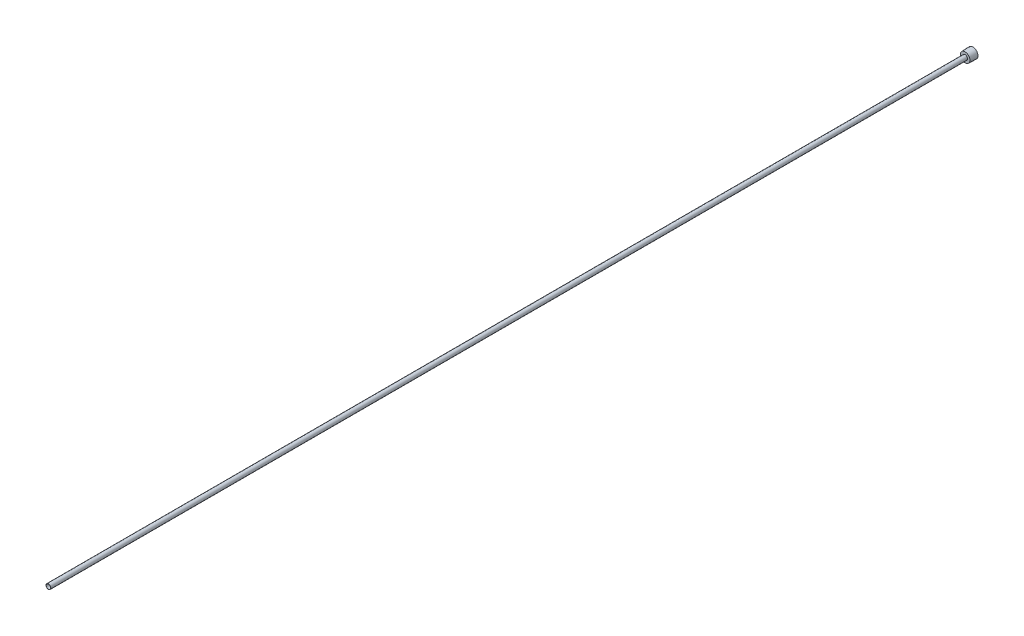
from build123d import *

# Parameters (mm, degrees)
SKETCH2_R          = 2.921
CUT_EXTRUDE1_DEPTH = 1220.23702007
CUT_EXTRUDE2_DEPTH = 6.35


with BuildPart() as part:
    # Sketch1 → Revolve1 (revolve)
    with BuildSketch(Plane(origin=(0, 0, 0), x_dir=(0, 0, -1), z_dir=(1, 0, 0)), mode=Mode.PRIVATE) as revolve1_sk:
        Polygon((0, 0), (-1219.2, 0), (-1219.2, 3.175), (-10.3124, 3.175), (-10.3124, 6.342143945), (0, 6.7183), align=None)
    revolve(revolve1_sk.sketch.rotate(Axis((0, 0, 331.124179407), (0, 0, -1)), 90), axis=Axis((0, 0, 331.124179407), (0, 0, -1)))

    # Sketch2 → Cut-Extrude1 (cut, through all)
    with BuildSketch(Plane.XY.offset(1219.2)):
        Circle(SKETCH2_R)
    extrude(amount=-CUT_EXTRUDE1_DEPTH, mode=Mode.SUBTRACT)

    # Sketch3 → Cut-Extrude2 (cut)
    with BuildSketch(Plane(origin=(0, 0, 0), x_dir=(-1, 0, 0), z_dir=(0, 0, -1))):
        Polygon((-3.175, -1.833087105), (0, -3.666174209), (3.175, -1.833087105), (3.175, 1.833087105), (0, 3.666174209), (-3.175, 1.833087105), align=None)
    extrude(amount=-CUT_EXTRUDE2_DEPTH, mode=Mode.SUBTRACT)


solid = part.part
